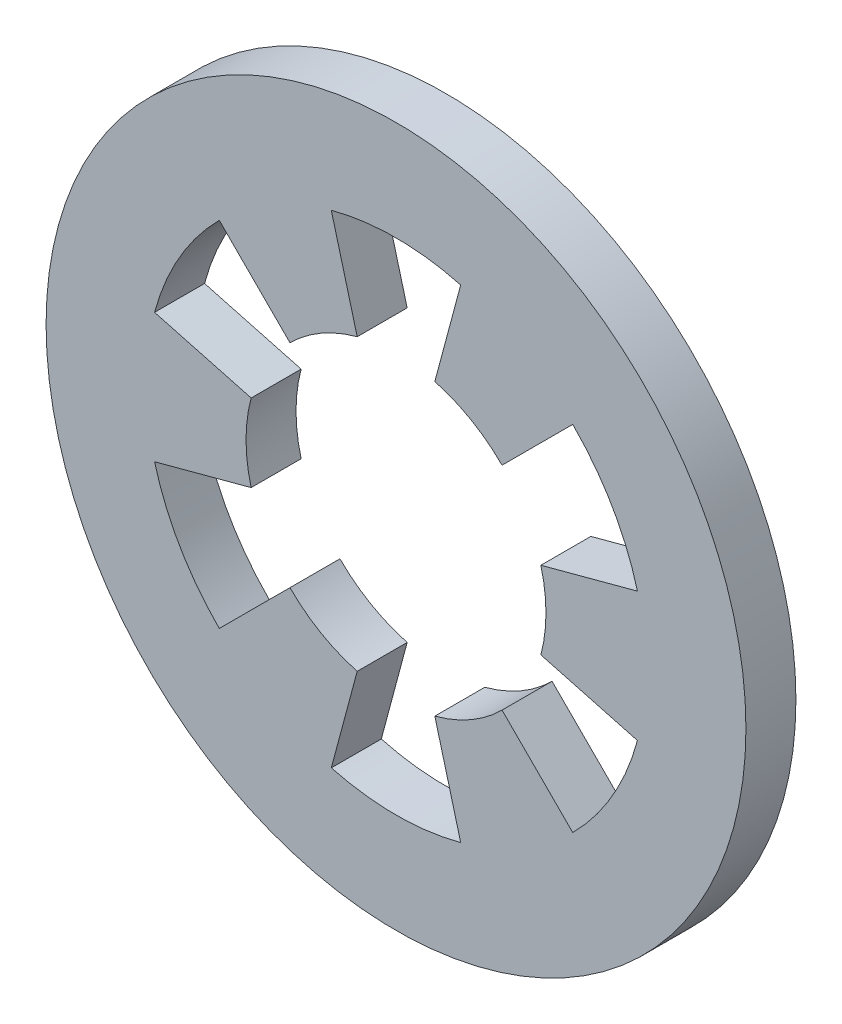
from build123d import *

# Parameters (mm, degrees)
ESQUISSE1_R                  = 3.5
ESQUISSE1_R_2                = 1.5
BASE_EXTRUSION_DEPTH         = 0.5
ENL_V_MAT_EXTRU_1_DEPTH      = 5.974937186
R_P_TITION_CIRCULAIRE1_COUNT = 6


with BuildPart() as part:
    # Esquisse1 → Base-Extrusion (new body)
    with BuildSketch(Plane.XY):
        Circle(ESQUISSE1_R)
        Circle(ESQUISSE1_R_2, mode=Mode.SUBTRACT)
    extrude(amount=BASE_EXTRUSION_DEPTH)

    # Esquisse2 → Enl_v. mat.-Extru.1 (cut, through all)
    with BuildSketch(Plane.XY.offset(0.5)):
        with BuildLine():
            Line((1.448888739, 0.388228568), (2.414814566, 0.647047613))
            ThreePointArc((2.414814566, 0.647047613), (2.165063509, 1.25), (1.767766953, 1.767766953))
            Line((1.767766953, 1.767766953), (1.060660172, 1.060660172))
            ThreePointArc((1.060660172, 1.060660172), (1.299038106, 0.75), (1.448888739, 0.388228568))
        make_face()
    enl_v_mat_extru_1 = extrude(amount=-ENL_V_MAT_EXTRU_1_DEPTH, mode=Mode.SUBTRACT)

    # R_p_tition circulaire1: Enl_v. mat.-Extru.1 ×6 about axis
    r_p_tition_circulaire1_axis = Axis((0, 0, 0), (0, 0, -1))
    for i in range(1, R_P_TITION_CIRCULAIRE1_COUNT):
        add(enl_v_mat_extru_1.rotate(r_p_tition_circulaire1_axis, i * 360 / R_P_TITION_CIRCULAIRE1_COUNT), mode=Mode.SUBTRACT)


solid = part.part
